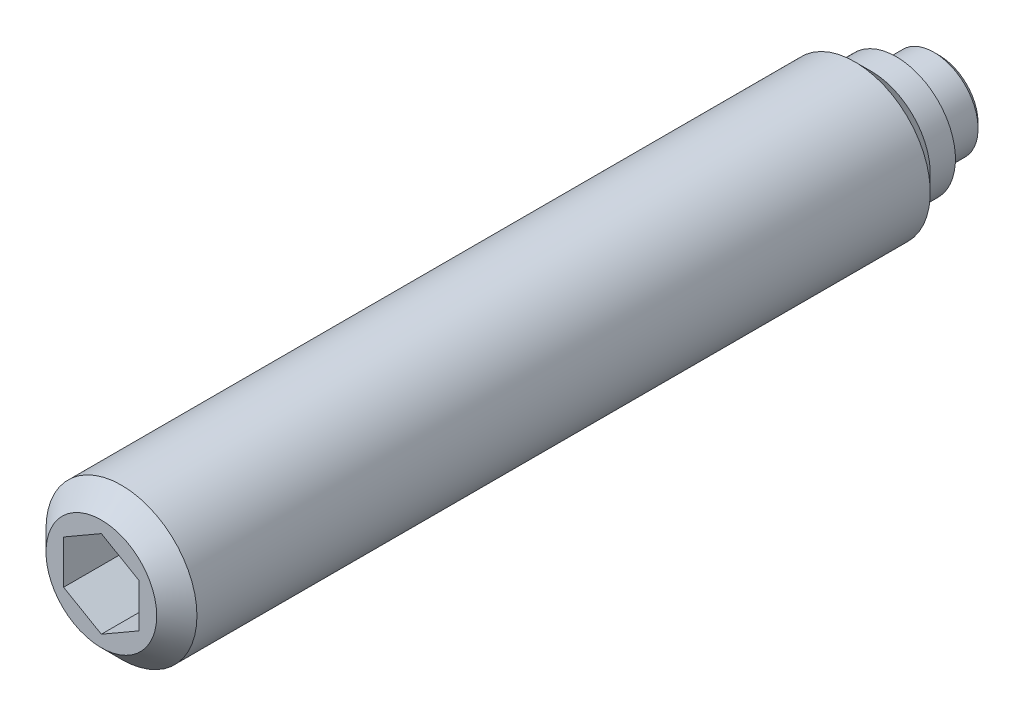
ISO-10303-21;
HEADER;
FILE_DESCRIPTION(('STEP AP214'),'2;1');
FILE_NAME('part.step','',(''),(''),'','','');
FILE_SCHEMA(('AUTOMOTIVE_DESIGN { 1 0 10303 214 1 1 1 1 }'));
ENDSEC;
DATA;
#1=APPLICATION_CONTEXT('core data for automotive mechanical design processes');
#2=APPLICATION_PROTOCOL_DEFINITION('international standard','automotive_design',2000,#1);
#3=PRODUCT_CONTEXT('',#1,'mechanical');
#4=PRODUCT('Part','Part','',(#3));
#5=PRODUCT_RELATED_PRODUCT_CATEGORY('part','',(#4));
#6=PRODUCT_DEFINITION_FORMATION('','',#4);
#7=PRODUCT_DEFINITION_CONTEXT('part definition',#1,'design');
#8=PRODUCT_DEFINITION('design','',#6,#7);
#9=PRODUCT_DEFINITION_SHAPE('','',#8);
#10=(LENGTH_UNIT() NAMED_UNIT(*) SI_UNIT(.MILLI.,.METRE.));
#11=(NAMED_UNIT(*) PLANE_ANGLE_UNIT() SI_UNIT($,.RADIAN.));
#12=(NAMED_UNIT(*) SI_UNIT($,.STERADIAN.) SOLID_ANGLE_UNIT());
#13=UNCERTAINTY_MEASURE_WITH_UNIT(LENGTH_MEASURE(1.E-05),#10,'distance_accuracy_value','');
#14=(GEOMETRIC_REPRESENTATION_CONTEXT(3) GLOBAL_UNCERTAINTY_ASSIGNED_CONTEXT((#13)) GLOBAL_UNIT_ASSIGNED_CONTEXT((#10,
#11,#12)) REPRESENTATION_CONTEXT('',''));
#15=CARTESIAN_POINT('',(0.,0.,0.));
#16=DIRECTION('',(0.,0.,1.));
#17=DIRECTION('',(1.,0.,0.));
#18=AXIS2_PLACEMENT_3D('',#15,#16,#17);
#19=CARTESIAN_POINT('',(0.,0.,1.7));
#20=DIRECTION('',(0.,0.,-1.));
#21=DIRECTION('',(-1.,0.,0.));
#22=AXIS2_PLACEMENT_3D('',#19,#20,#21);
#23=CYLINDRICAL_SURFACE('',#22,3.);
#24=CARTESIAN_POINT('',(0.,0.,32.5));
#25=DIRECTION('',(0.,0.,1.));
#26=DIRECTION('',(1.,0.,0.));
#27=AXIS2_PLACEMENT_3D('',#24,#25,#26);
#28=CIRCLE('',#27,3.);
#29=CARTESIAN_POINT('',(3.,0.,32.5));
#30=VERTEX_POINT('',#29);
#31=EDGE_CURVE('E9',#30,#30,#28,.F.);
#32=ORIENTED_EDGE('',*,*,#31,.T.);
#33=EDGE_LOOP('',(#32));
#34=FACE_BOUND('',#33,.T.);
#35=CARTESIAN_POINT('',(0.,0.,3.35));
#36=DIRECTION('',(0.,0.,-1.));
#37=DIRECTION('',(-1.,0.,0.));
#38=AXIS2_PLACEMENT_3D('',#35,#36,#37);
#39=CIRCLE('',#38,3.);
#40=CARTESIAN_POINT('',(-3.,0.,3.35));
#41=VERTEX_POINT('',#40);
#42=EDGE_CURVE('E74',#41,#41,#39,.T.);
#43=ORIENTED_EDGE('',*,*,#42,.F.);
#44=EDGE_LOOP('',(#43));
#45=FACE_BOUND('',#44,.T.);
#46=ADVANCED_FACE('F14',(#34,#45),#23,.T.);
#47=CARTESIAN_POINT('',(0.,0.,0.));
#48=DIRECTION('',(0.,0.,-1.));
#49=DIRECTION('',(-1.,0.,0.));
#50=AXIS2_PLACEMENT_3D('',#47,#48,#49);
#51=CYLINDRICAL_SURFACE('',#50,1.75);
#52=CARTESIAN_POINT('',(0.,0.,0.2));
#53=DIRECTION('',(0.,0.,-1.));
#54=DIRECTION('',(-1.,0.,0.));
#55=AXIS2_PLACEMENT_3D('',#52,#53,#54);
#56=CIRCLE('',#55,1.75);
#57=CARTESIAN_POINT('',(-1.75,0.,0.2));
#58=VERTEX_POINT('',#57);
#59=EDGE_CURVE('E106',#58,#58,#56,.T.);
#60=ORIENTED_EDGE('',*,*,#59,.F.);
#61=EDGE_LOOP('',(#60));
#62=FACE_BOUND('',#61,.T.);
#63=CARTESIAN_POINT('',(0.,0.,1.7));
#64=DIRECTION('',(0.,0.,-1.));
#65=DIRECTION('',(-1.,0.,0.));
#66=AXIS2_PLACEMENT_3D('',#63,#64,#65);
#67=CIRCLE('',#66,1.75);
#68=CARTESIAN_POINT('',(-1.75,0.,1.7));
#69=VERTEX_POINT('',#68);
#70=EDGE_CURVE('E100',#69,#69,#67,.T.);
#71=ORIENTED_EDGE('',*,*,#70,.T.);
#72=EDGE_LOOP('',(#71));
#73=FACE_BOUND('',#72,.T.);
#74=ADVANCED_FACE('F130',(#62,#73),#51,.T.);
#75=CARTESIAN_POINT('',(0.,0.,0.2));
#76=DIRECTION('',(0.,0.,1.));
#77=DIRECTION('',(1.,0.,0.));
#78=AXIS2_PLACEMENT_3D('',#75,#76,#77);
#79=CONICAL_SURFACE('',#78,1.75,0.785398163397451);
#80=CARTESIAN_POINT('',(0.,0.,0.));
#81=DIRECTION('',(0.,0.,-1.));
#82=DIRECTION('',(-1.,0.,0.));
#83=AXIS2_PLACEMENT_3D('',#80,#81,#82);
#84=CIRCLE('',#83,1.55);
#85=CARTESIAN_POINT('',(-1.55,0.,0.));
#86=VERTEX_POINT('',#85);
#87=EDGE_CURVE('E103',#86,#86,#84,.T.);
#88=ORIENTED_EDGE('',*,*,#87,.F.);
#89=EDGE_LOOP('',(#88));
#90=FACE_BOUND('',#89,.T.);
#91=ORIENTED_EDGE('',*,*,#59,.T.);
#92=EDGE_LOOP('',(#91));
#93=FACE_BOUND('',#92,.T.);
#94=ADVANCED_FACE('F135',(#90,#93),#79,.T.);
#95=CARTESIAN_POINT('',(0.,1.55,0.));
#96=DIRECTION('',(0.,0.,1.));
#97=DIRECTION('',(1.,0.,0.));
#98=AXIS2_PLACEMENT_3D('',#95,#96,#97);
#99=PLANE('',#98);
#100=ORIENTED_EDGE('',*,*,#87,.T.);
#101=EDGE_LOOP('',(#100));
#102=FACE_BOUND('',#101,.T.);
#103=ADVANCED_FACE('F150',(#102),#99,.F.);
#104=CARTESIAN_POINT('',(0.,2.35,1.7));
#105=DIRECTION('',(0.,0.,1.));
#106=DIRECTION('',(1.,0.,0.));
#107=AXIS2_PLACEMENT_3D('',#104,#105,#106);
#108=PLANE('',#107);
#109=CARTESIAN_POINT('',(0.,0.,1.7));
#110=DIRECTION('',(0.,0.,-1.));
#111=DIRECTION('',(-1.,0.,0.));
#112=AXIS2_PLACEMENT_3D('',#109,#110,#111);
#113=CIRCLE('',#112,2.35);
#114=CARTESIAN_POINT('',(-2.35,0.,1.7));
#115=VERTEX_POINT('',#114);
#116=EDGE_CURVE('E109',#115,#115,#113,.T.);
#117=ORIENTED_EDGE('',*,*,#116,.T.);
#118=EDGE_LOOP('',(#117));
#119=FACE_BOUND('',#118,.T.);
#120=ORIENTED_EDGE('',*,*,#70,.F.);
#121=EDGE_LOOP('',(#120));
#122=FACE_BOUND('',#121,.T.);
#123=ADVANCED_FACE('F147',(#119,#122),#108,.F.);
#124=CARTESIAN_POINT('',(0.,0.,1.7));
#125=DIRECTION('',(0.,0.,-1.));
#126=DIRECTION('',(-1.,0.,0.));
#127=AXIS2_PLACEMENT_3D('',#124,#125,#126);
#128=CYLINDRICAL_SURFACE('',#127,2.35);
#129=CARTESIAN_POINT('',(0.,0.,2.7));
#130=DIRECTION('',(0.,0.,-1.));
#131=DIRECTION('',(-1.,0.,0.));
#132=AXIS2_PLACEMENT_3D('',#129,#130,#131);
#133=CIRCLE('',#132,2.35);
#134=CARTESIAN_POINT('',(-2.35,0.,2.7));
#135=VERTEX_POINT('',#134);
#136=EDGE_CURVE('E112',#135,#135,#133,.T.);
#137=ORIENTED_EDGE('',*,*,#136,.T.);
#138=EDGE_LOOP('',(#137));
#139=FACE_BOUND('',#138,.T.);
#140=ORIENTED_EDGE('',*,*,#116,.F.);
#141=EDGE_LOOP('',(#140));
#142=FACE_BOUND('',#141,.T.);
#143=ADVANCED_FACE('F143',(#139,#142),#128,.T.);
#144=CARTESIAN_POINT('',(0.,0.,3.35));
#145=DIRECTION('',(0.,0.,1.));
#146=DIRECTION('',(1.,0.,0.));
#147=AXIS2_PLACEMENT_3D('',#144,#145,#146);
#148=CONICAL_SURFACE('',#147,3.,0.785398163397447);
#149=ORIENTED_EDGE('',*,*,#42,.T.);
#150=EDGE_LOOP('',(#149));
#151=FACE_BOUND('',#150,.T.);
#152=ORIENTED_EDGE('',*,*,#136,.F.);
#153=EDGE_LOOP('',(#152));
#154=FACE_BOUND('',#153,.T.);
#155=ADVANCED_FACE('F140',(#151,#154),#148,.T.);
#156=CARTESIAN_POINT('',(0.,0.,33.3));
#157=DIRECTION('',(0.,0.,1.));
#158=DIRECTION('',(1.,0.,0.));
#159=AXIS2_PLACEMENT_3D('',#156,#157,#158);
#160=PLANE('',#159);
#161=CARTESIAN_POINT('',(0.,0.,33.3));
#162=DIRECTION('',(0.,0.,1.));
#163=DIRECTION('',(1.,0.,0.));
#164=AXIS2_PLACEMENT_3D('',#161,#162,#163);
#165=CIRCLE('',#164,2.2);
#166=CARTESIAN_POINT('',(2.2,0.,33.3));
#167=VERTEX_POINT('',#166);
#168=EDGE_CURVE('E22',#167,#167,#165,.T.);
#169=ORIENTED_EDGE('',*,*,#168,.T.);
#170=EDGE_LOOP('',(#169));
#171=FACE_BOUND('',#170,.T.);
#172=DIRECTION('',(-0.866025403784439,0.5,0.));
#173=VECTOR('',#172,1.);
#174=CARTESIAN_POINT('',(-1.5,-0.866025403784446,33.3));
#175=LINE('',#174,#173);
#176=CARTESIAN_POINT('',(0.,-1.73205080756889,33.3));
#177=VERTEX_POINT('',#176);
#178=CARTESIAN_POINT('',(-1.5,-0.866025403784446,33.3));
#179=VERTEX_POINT('',#178);
#180=EDGE_CURVE('E69',#177,#179,#175,.T.);
#181=ORIENTED_EDGE('',*,*,#180,.T.);
#182=DIRECTION('',(0.,1.,0.));
#183=VECTOR('',#182,1.);
#184=CARTESIAN_POINT('',(-1.5,0.866025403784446,33.3));
#185=LINE('',#184,#183);
#186=CARTESIAN_POINT('',(-1.5,0.866025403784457,33.3));
#187=VERTEX_POINT('',#186);
#188=EDGE_CURVE('E84',#179,#187,#185,.T.);
#189=ORIENTED_EDGE('',*,*,#188,.T.);
#190=DIRECTION('',(0.866025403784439,0.5,0.));
#191=VECTOR('',#190,1.);
#192=CARTESIAN_POINT('',(0.,1.73205080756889,33.3));
#193=LINE('',#192,#191);
#194=CARTESIAN_POINT('',(0.,1.73205080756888,33.3));
#195=VERTEX_POINT('',#194);
#196=EDGE_CURVE('E301',#187,#195,#193,.T.);
#197=ORIENTED_EDGE('',*,*,#196,.T.);
#198=DIRECTION('',(0.866025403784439,-0.5,0.));
#199=VECTOR('',#198,1.);
#200=CARTESIAN_POINT('',(1.5,0.866025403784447,33.3));
#201=LINE('',#200,#199);
#202=CARTESIAN_POINT('',(1.5,0.866025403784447,33.3));
#203=VERTEX_POINT('',#202);
#204=EDGE_CURVE('E298',#195,#203,#201,.T.);
#205=ORIENTED_EDGE('',*,*,#204,.T.);
#206=DIRECTION('',(0.,-1.,0.));
#207=VECTOR('',#206,1.);
#208=CARTESIAN_POINT('',(1.5,-0.866025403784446,33.3));
#209=LINE('',#208,#207);
#210=CARTESIAN_POINT('',(1.5,-0.866025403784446,33.3));
#211=VERTEX_POINT('',#210);
#212=EDGE_CURVE('E29',#203,#211,#209,.T.);
#213=ORIENTED_EDGE('',*,*,#212,.T.);
#214=DIRECTION('',(-0.866025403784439,-0.5,0.));
#215=VECTOR('',#214,1.);
#216=CARTESIAN_POINT('',(0.,-1.73205080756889,33.3));
#217=LINE('',#216,#215);
#218=EDGE_CURVE('E66',#211,#177,#217,.T.);
#219=ORIENTED_EDGE('',*,*,#218,.T.);
#220=EDGE_LOOP('',(#181,#189,#197,#205,#213,#219));
#221=FACE_BOUND('',#220,.T.);
#222=ADVANCED_FACE('F68',(#171,#221),#160,.T.);
#223=CARTESIAN_POINT('',(0.,0.,29.8));
#224=DIRECTION('',(0.,0.,1.));
#225=DIRECTION('',(1.,0.,0.));
#226=AXIS2_PLACEMENT_3D('',#223,#224,#225);
#227=PLANE('',#226);
#228=DIRECTION('',(0.,-1.,0.));
#229=VECTOR('',#228,1.);
#230=CARTESIAN_POINT('',(-1.5,0.866025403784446,29.8));
#231=LINE('',#230,#229);
#232=CARTESIAN_POINT('',(-1.5,0.866025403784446,29.8));
#233=VERTEX_POINT('',#232);
#234=CARTESIAN_POINT('',(-1.5,-0.866025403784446,29.8));
#235=VERTEX_POINT('',#234);
#236=EDGE_CURVE('E83',#233,#235,#231,.T.);
#237=ORIENTED_EDGE('',*,*,#236,.T.);
#238=DIRECTION('',(0.866025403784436,-0.5,0.));
#239=VECTOR('',#238,1.);
#240=CARTESIAN_POINT('',(-1.5,-0.866025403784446,29.8));
#241=LINE('',#240,#239);
#242=CARTESIAN_POINT('',(0.,-1.73205080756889,29.8));
#243=VERTEX_POINT('',#242);
#244=EDGE_CURVE('E280',#235,#243,#241,.T.);
#245=ORIENTED_EDGE('',*,*,#244,.T.);
#246=DIRECTION('',(0.866025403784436,0.5,0.));
#247=VECTOR('',#246,1.);
#248=CARTESIAN_POINT('',(0.,-1.73205080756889,29.8));
#249=LINE('',#248,#247);
#250=CARTESIAN_POINT('',(1.5,-0.866025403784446,29.8));
#251=VERTEX_POINT('',#250);
#252=EDGE_CURVE('E88',#243,#251,#249,.T.);
#253=ORIENTED_EDGE('',*,*,#252,.T.);
#254=DIRECTION('',(0.,1.,0.));
#255=VECTOR('',#254,1.);
#256=CARTESIAN_POINT('',(1.5,-0.866025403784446,29.8));
#257=LINE('',#256,#255);
#258=CARTESIAN_POINT('',(1.5,0.866025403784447,29.8));
#259=VERTEX_POINT('',#258);
#260=EDGE_CURVE('E287',#251,#259,#257,.T.);
#261=ORIENTED_EDGE('',*,*,#260,.T.);
#262=DIRECTION('',(-0.866025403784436,0.5,0.));
#263=VECTOR('',#262,1.);
#264=CARTESIAN_POINT('',(1.5,0.866025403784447,29.8));
#265=LINE('',#264,#263);
#266=CARTESIAN_POINT('',(0.,1.73205080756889,29.8));
#267=VERTEX_POINT('',#266);
#268=EDGE_CURVE('E96',#259,#267,#265,.T.);
#269=ORIENTED_EDGE('',*,*,#268,.T.);
#270=DIRECTION('',(-0.866025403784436,-0.5,0.));
#271=VECTOR('',#270,1.);
#272=CARTESIAN_POINT('',(0.,1.73205080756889,29.8));
#273=LINE('',#272,#271);
#274=EDGE_CURVE('E91',#267,#233,#273,.T.);
#275=ORIENTED_EDGE('',*,*,#274,.T.);
#276=EDGE_LOOP('',(#237,#245,#253,#261,#269,#275));
#277=FACE_BOUND('',#276,.T.);
#278=ADVANCED_FACE('F162',(#277),#227,.T.);
#279=CARTESIAN_POINT('',(0.,-1.73205080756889,37.8));
#280=DIRECTION('',(0.5,-0.866025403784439,0.));
#281=DIRECTION('',(0.866025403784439,0.5,0.));
#282=AXIS2_PLACEMENT_3D('',#279,#280,#281);
#283=PLANE('',#282);
#284=ORIENTED_EDGE('',*,*,#218,.F.);
#285=DIRECTION('',(0.,0.,1.));
#286=VECTOR('',#285,1.);
#287=CARTESIAN_POINT('',(1.5,-0.866025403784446,37.8));
#288=LINE('',#287,#286);
#289=EDGE_CURVE('E90',#251,#211,#288,.T.);
#290=ORIENTED_EDGE('',*,*,#289,.F.);
#291=ORIENTED_EDGE('',*,*,#252,.F.);
#292=DIRECTION('',(0.,0.,1.));
#293=VECTOR('',#292,1.);
#294=CARTESIAN_POINT('',(0.,-1.73205080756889,37.8));
#295=LINE('',#294,#293);
#296=EDGE_CURVE('E80',#243,#177,#295,.T.);
#297=ORIENTED_EDGE('',*,*,#296,.T.);
#298=EDGE_LOOP('',(#284,#290,#291,#297));
#299=FACE_BOUND('',#298,.T.);
#300=ADVANCED_FACE('F86',(#299),#283,.F.);
#301=CARTESIAN_POINT('',(1.5,-0.866025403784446,37.8));
#302=DIRECTION('',(1.,0.,0.));
#303=DIRECTION('',(0.,1.,0.));
#304=AXIS2_PLACEMENT_3D('',#301,#302,#303);
#305=PLANE('',#304);
#306=ORIENTED_EDGE('',*,*,#212,.F.);
#307=DIRECTION('',(0.,0.,1.));
#308=VECTOR('',#307,1.);
#309=CARTESIAN_POINT('',(1.5,0.866025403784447,37.8));
#310=LINE('',#309,#308);
#311=EDGE_CURVE('E93',#259,#203,#310,.T.);
#312=ORIENTED_EDGE('',*,*,#311,.F.);
#313=ORIENTED_EDGE('',*,*,#260,.F.);
#314=ORIENTED_EDGE('',*,*,#289,.T.);
#315=EDGE_LOOP('',(#306,#312,#313,#314));
#316=FACE_BOUND('',#315,.T.);
#317=ADVANCED_FACE('F161',(#316),#305,.F.);
#318=CARTESIAN_POINT('',(1.5,0.866025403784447,37.8));
#319=DIRECTION('',(0.5,0.866025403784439,0.));
#320=DIRECTION('',(-0.866025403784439,0.5,0.));
#321=AXIS2_PLACEMENT_3D('',#318,#319,#320);
#322=PLANE('',#321);
#323=ORIENTED_EDGE('',*,*,#204,.F.);
#324=DIRECTION('',(0.,0.,1.));
#325=VECTOR('',#324,1.);
#326=CARTESIAN_POINT('',(0.,1.73205080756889,37.8));
#327=LINE('',#326,#325);
#328=EDGE_CURVE('E293',#267,#195,#327,.T.);
#329=ORIENTED_EDGE('',*,*,#328,.F.);
#330=ORIENTED_EDGE('',*,*,#268,.F.);
#331=ORIENTED_EDGE('',*,*,#311,.T.);
#332=EDGE_LOOP('',(#323,#329,#330,#331));
#333=FACE_BOUND('',#332,.T.);
#334=ADVANCED_FACE('F165',(#333),#322,.F.);
#335=CARTESIAN_POINT('',(0.,1.73205080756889,37.8));
#336=DIRECTION('',(-0.5,0.866025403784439,0.));
#337=DIRECTION('',(-0.866025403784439,-0.5,0.));
#338=AXIS2_PLACEMENT_3D('',#335,#336,#337);
#339=PLANE('',#338);
#340=ORIENTED_EDGE('',*,*,#196,.F.);
#341=DIRECTION('',(0.,0.,1.));
#342=VECTOR('',#341,1.);
#343=CARTESIAN_POINT('',(-1.5,0.866025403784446,37.8));
#344=LINE('',#343,#342);
#345=EDGE_CURVE('E37',#233,#187,#344,.T.);
#346=ORIENTED_EDGE('',*,*,#345,.F.);
#347=ORIENTED_EDGE('',*,*,#274,.F.);
#348=ORIENTED_EDGE('',*,*,#328,.T.);
#349=EDGE_LOOP('',(#340,#346,#347,#348));
#350=FACE_BOUND('',#349,.T.);
#351=ADVANCED_FACE('F169',(#350),#339,.F.);
#352=CARTESIAN_POINT('',(-1.5,0.866025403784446,37.8));
#353=DIRECTION('',(-1.,0.,0.));
#354=DIRECTION('',(0.,0.,1.));
#355=AXIS2_PLACEMENT_3D('',#352,#353,#354);
#356=PLANE('',#355);
#357=ORIENTED_EDGE('',*,*,#188,.F.);
#358=DIRECTION('',(0.,0.,1.));
#359=VECTOR('',#358,1.);
#360=CARTESIAN_POINT('',(-1.5,-0.866025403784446,37.8));
#361=LINE('',#360,#359);
#362=EDGE_CURVE('E82',#235,#179,#361,.T.);
#363=ORIENTED_EDGE('',*,*,#362,.F.);
#364=ORIENTED_EDGE('',*,*,#236,.F.);
#365=ORIENTED_EDGE('',*,*,#345,.T.);
#366=EDGE_LOOP('',(#357,#363,#364,#365));
#367=FACE_BOUND('',#366,.T.);
#368=ADVANCED_FACE('F126',(#367),#356,.F.);
#369=CARTESIAN_POINT('',(-1.5,-0.866025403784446,37.8));
#370=DIRECTION('',(-0.5,-0.866025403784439,0.));
#371=DIRECTION('',(0.866025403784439,-0.5,0.));
#372=AXIS2_PLACEMENT_3D('',#369,#370,#371);
#373=PLANE('',#372);
#374=ORIENTED_EDGE('',*,*,#180,.F.);
#375=ORIENTED_EDGE('',*,*,#296,.F.);
#376=ORIENTED_EDGE('',*,*,#244,.F.);
#377=ORIENTED_EDGE('',*,*,#362,.T.);
#378=EDGE_LOOP('',(#374,#375,#376,#377));
#379=FACE_BOUND('',#378,.T.);
#380=ADVANCED_FACE('F78',(#379),#373,.F.);
#381=CARTESIAN_POINT('',(0.,0.,33.3));
#382=DIRECTION('',(0.,0.,-1.));
#383=DIRECTION('',(-1.,0.,0.));
#384=AXIS2_PLACEMENT_3D('',#381,#382,#383);
#385=CONICAL_SURFACE('',#384,2.2,0.785398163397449);
#386=ORIENTED_EDGE('',*,*,#31,.F.);
#387=EDGE_LOOP('',(#386));
#388=FACE_BOUND('',#387,.T.);
#389=ORIENTED_EDGE('',*,*,#168,.F.);
#390=EDGE_LOOP('',(#389));
#391=FACE_BOUND('',#390,.T.);
#392=ADVANCED_FACE('F16',(#388,#391),#385,.T.);
#393=CLOSED_SHELL('',(#46,#74,#94,#103,#123,#143,#155,#222,#278,#300,#317,#334,#351,#368,#380,#392));
#394=MANIFOLD_SOLID_BREP('B1',#393);
#395=ADVANCED_BREP_SHAPE_REPRESENTATION('',(#18,#394),#14);
#396=SHAPE_DEFINITION_REPRESENTATION(#9,#395);
ENDSEC;
END-ISO-10303-21;
